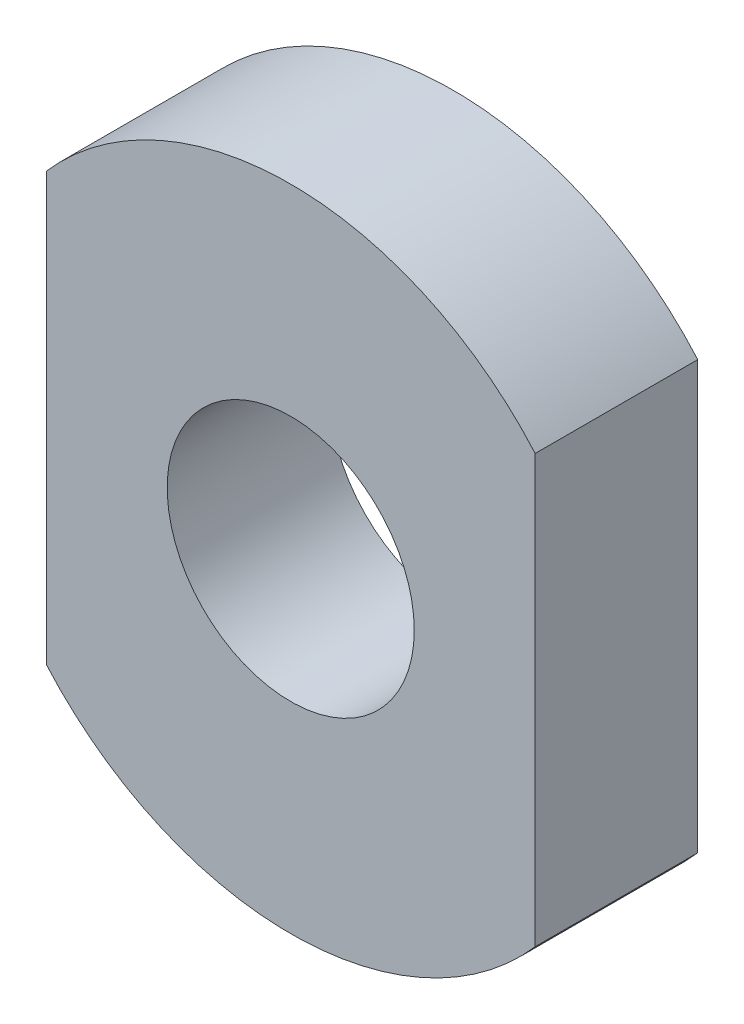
from build123d import *

# Parameters (mm, degrees)
SKETCH1_R          = 2.413
BASE_EXTRUDE_DEPTH = 3.175


with BuildPart() as part:
    # Sketch1 → Base-Extrude (new body)
    with BuildSketch(Plane.XY):
        with BuildLine():
            Line((4.7752, 4.171839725), (4.7752, -4.171839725))
            ThreePointArc((4.7752, -4.171839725), (0, -6.340881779), (-4.7752, -4.171839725))
            Line((-4.7752, -4.171839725), (-4.7752, 4.171839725))
            ThreePointArc((-4.7752, 4.171839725), (0, 6.340881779), (4.7752, 4.171839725))
        make_face()
        Circle(SKETCH1_R, mode=Mode.SUBTRACT)
    extrude(amount=BASE_EXTRUDE_DEPTH)


solid = part.part
